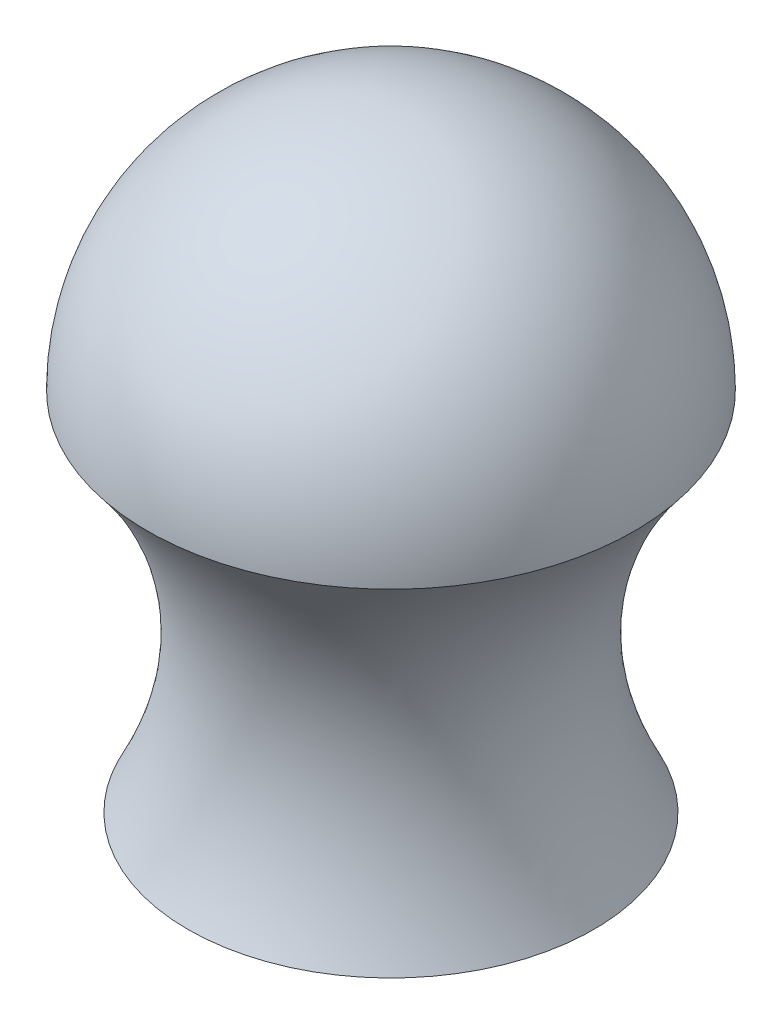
ISO-10303-21;
HEADER;
FILE_DESCRIPTION(('STEP AP214'),'2;1');
FILE_NAME('part.step','',(''),(''),'','','');
FILE_SCHEMA(('AUTOMOTIVE_DESIGN { 1 0 10303 214 1 1 1 1 }'));
ENDSEC;
DATA;
#1=APPLICATION_CONTEXT('core data for automotive mechanical design processes');
#2=APPLICATION_PROTOCOL_DEFINITION('international standard','automotive_design',2000,#1);
#3=PRODUCT_CONTEXT('',#1,'mechanical');
#4=PRODUCT('Part','Part','',(#3));
#5=PRODUCT_RELATED_PRODUCT_CATEGORY('part','',(#4));
#6=PRODUCT_DEFINITION_FORMATION('','',#4);
#7=PRODUCT_DEFINITION_CONTEXT('part definition',#1,'design');
#8=PRODUCT_DEFINITION('design','',#6,#7);
#9=PRODUCT_DEFINITION_SHAPE('','',#8);
#10=(LENGTH_UNIT() NAMED_UNIT(*) SI_UNIT(.MILLI.,.METRE.));
#11=(NAMED_UNIT(*) PLANE_ANGLE_UNIT() SI_UNIT($,.RADIAN.));
#12=(NAMED_UNIT(*) SI_UNIT($,.STERADIAN.) SOLID_ANGLE_UNIT());
#13=UNCERTAINTY_MEASURE_WITH_UNIT(LENGTH_MEASURE(1.E-05),#10,'distance_accuracy_value','');
#14=(GEOMETRIC_REPRESENTATION_CONTEXT(3) GLOBAL_UNCERTAINTY_ASSIGNED_CONTEXT((#13)) GLOBAL_UNIT_ASSIGNED_CONTEXT((#10,
#11,#12)) REPRESENTATION_CONTEXT('',''));
#15=CARTESIAN_POINT('',(0.,0.,0.));
#16=DIRECTION('',(0.,0.,1.));
#17=DIRECTION('',(1.,0.,0.));
#18=AXIS2_PLACEMENT_3D('',#15,#16,#17);
#19=CARTESIAN_POINT('',(0.,0.,0.));
#20=DIRECTION('',(0.,-1.,0.));
#21=DIRECTION('',(0.,0.,-1.));
#22=AXIS2_PLACEMENT_3D('',#19,#20,#21);
#23=SPHERICAL_SURFACE('',#22,15.24);
#24=CARTESIAN_POINT('',(0.,0.,0.));
#25=DIRECTION('',(0.,-1.,0.));
#26=DIRECTION('',(0.,0.,-1.));
#27=AXIS2_PLACEMENT_3D('',#24,#25,#26);
#28=CIRCLE('',#27,15.24);
#29=CARTESIAN_POINT('',(0.,0.,-15.24));
#30=VERTEX_POINT('',#29);
#31=EDGE_CURVE('E10',#30,#30,#28,.T.);
#32=ORIENTED_EDGE('',*,*,#31,.F.);
#33=EDGE_LOOP('',(#32));
#34=FACE_BOUND('',#33,.T.);
#35=ADVANCED_FACE('F31',(#34),#23,.T.);
#36=CARTESIAN_POINT('',(0.,-22.86,-12.7));
#37=CARTESIAN_POINT('',(0.,-10.7777235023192,-6.58240560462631));
#38=CARTESIAN_POINT('',(0.,0.,-15.24));
#39=B_SPLINE_CURVE_WITH_KNOTS('',2,(#36,#37,#38),.UNSPECIFIED.,.F.,.F.,(3,3),(0.,1.),.UNSPECIFIED.);
#40=CARTESIAN_POINT('',(0.,-22.86,0.));
#41=DIRECTION('',(0.,-1.,0.));
#42=AXIS1_PLACEMENT('',#40,#41);
#43=SURFACE_OF_REVOLUTION('',#39,#42);
#44=ORIENTED_EDGE('',*,*,#31,.T.);
#45=EDGE_LOOP('',(#44));
#46=FACE_BOUND('',#45,.T.);
#47=CARTESIAN_POINT('',(0.,-22.86,0.));
#48=DIRECTION('',(0.,-1.,0.));
#49=DIRECTION('',(0.,0.,-1.));
#50=AXIS2_PLACEMENT_3D('',#47,#48,#49);
#51=CIRCLE('',#50,12.7);
#52=CARTESIAN_POINT('',(0.,-22.86,-12.7));
#53=VERTEX_POINT('',#52);
#54=EDGE_CURVE('E37',#53,#53,#51,.T.);
#55=ORIENTED_EDGE('',*,*,#54,.F.);
#56=EDGE_LOOP('',(#55));
#57=FACE_BOUND('',#56,.T.);
#58=ADVANCED_FACE('F55',(#46,#57),#43,.F.);
#59=CARTESIAN_POINT('',(0.,-22.86,-12.7));
#60=DIRECTION('',(0.,-1.,0.));
#61=DIRECTION('',(0.,0.,-1.));
#62=AXIS2_PLACEMENT_3D('',#59,#60,#61);
#63=PLANE('',#62);
#64=CARTESIAN_POINT('',(0.,-22.86,0.));
#65=DIRECTION('',(0.,-1.,0.));
#66=DIRECTION('',(0.,0.,-1.));
#67=AXIS2_PLACEMENT_3D('',#64,#65,#66);
#68=CIRCLE('',#67,2.54);
#69=CARTESIAN_POINT('',(0.,-22.86,-2.54));
#70=VERTEX_POINT('',#69);
#71=EDGE_CURVE('E45',#70,#70,#68,.T.);
#72=ORIENTED_EDGE('',*,*,#71,.F.);
#73=EDGE_LOOP('',(#72));
#74=FACE_BOUND('',#73,.T.);
#75=ORIENTED_EDGE('',*,*,#54,.T.);
#76=EDGE_LOOP('',(#75));
#77=FACE_BOUND('',#76,.T.);
#78=ADVANCED_FACE('F58',(#74,#77),#63,.T.);
#79=CARTESIAN_POINT('',(0.,-12.7,0.));
#80=DIRECTION('',(0.,-1.,0.));
#81=DIRECTION('',(0.,0.,-1.));
#82=AXIS2_PLACEMENT_3D('',#79,#80,#81);
#83=CYLINDRICAL_SURFACE('',#82,2.54);
#84=CARTESIAN_POINT('',(0.,-12.7,0.));
#85=DIRECTION('',(0.,-1.,0.));
#86=DIRECTION('',(0.,0.,-1.));
#87=AXIS2_PLACEMENT_3D('',#84,#85,#86);
#88=CIRCLE('',#87,2.54);
#89=CARTESIAN_POINT('',(0.,-12.7,-2.54));
#90=VERTEX_POINT('',#89);
#91=EDGE_CURVE('E41',#90,#90,#88,.T.);
#92=ORIENTED_EDGE('',*,*,#91,.F.);
#93=EDGE_LOOP('',(#92));
#94=FACE_BOUND('',#93,.T.);
#95=ORIENTED_EDGE('',*,*,#71,.T.);
#96=EDGE_LOOP('',(#95));
#97=FACE_BOUND('',#96,.T.);
#98=ADVANCED_FACE('F61',(#94,#97),#83,.F.);
#99=CARTESIAN_POINT('',(0.,-12.7,0.));
#100=DIRECTION('',(0.,-1.,0.));
#101=DIRECTION('',(0.,0.,-1.));
#102=AXIS2_PLACEMENT_3D('',#99,#100,#101);
#103=PLANE('',#102);
#104=ORIENTED_EDGE('',*,*,#91,.T.);
#105=EDGE_LOOP('',(#104));
#106=FACE_BOUND('',#105,.T.);
#107=ADVANCED_FACE('F65',(#106),#103,.T.);
#108=CLOSED_SHELL('',(#35,#58,#78,#98,#107));
#109=MANIFOLD_SOLID_BREP('B2',#108);
#110=ADVANCED_BREP_SHAPE_REPRESENTATION('',(#18,#109),#14);
#111=SHAPE_DEFINITION_REPRESENTATION(#9,#110);
ENDSEC;
END-ISO-10303-21;
